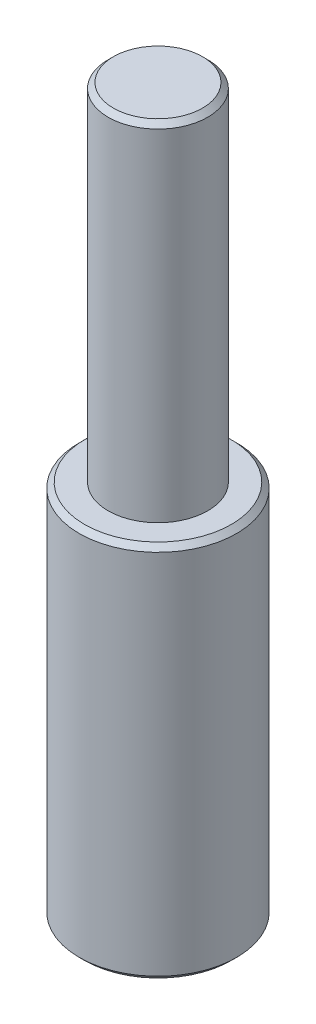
from build123d import *

# Parameters (mm, degrees)
SKETCH1_R                   = 1.5
BOSS_EXTRUDE1_DEPTH         = 7.2
SKETCH2_R                   = 0.95
BOSS_EXTRUDE2_DEPTH         = 6.6
CHAMFER1_SIZE               = 0.1
TAP_DRILL_FOR_M2_TAP1_D     = 1.6
TAP_DRILL_FOR_M2_TAP1_DEPTH = 5
TAP_DRILL_FOR_M2_TAP1_TIP   = 0.480688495


with BuildPart() as part:
    # Sketch1 → Boss-Extrude1 (new body)
    with BuildSketch(Plane(origin=(0, 0, 0), x_dir=(1, 0, 0), z_dir=(0, 1, 0))):
        with Locations(Location((0, 0, 0), (0, 0, 270))):
            Circle(SKETCH1_R)
    extrude(amount=BOSS_EXTRUDE1_DEPTH)

    # Sketch2 → Boss-Extrude2 (add)
    with BuildSketch(Plane(origin=(0, 7.2, 0), x_dir=(1, 0, 0), z_dir=(0, 1, 0))):
        with Locations(Location((0, 0, 0), (0, 0, 270))):
            Circle(SKETCH2_R)
    extrude(amount=BOSS_EXTRUDE2_DEPTH)

    # Chamfer1
    chamfer1_edges = [part.edges().sort_by_distance(p)[0] for p in [
        (0, 0, -1.5),
        (0, 7.2, -1.5),
        (0, 13.8, -0.95),
    ]]
    chamfer(chamfer1_edges, length=CHAMFER1_SIZE)

    # Tap Drill for M2 Tap1
    with Locations(Plane(origin=(0, 0, 0), x_dir=(-1, 0, 0), z_dir=(0, -1, 0))):
        with Locations((0, 0)):
            Hole(TAP_DRILL_FOR_M2_TAP1_D / 2, depth=TAP_DRILL_FOR_M2_TAP1_DEPTH)
            with Locations((0, 0, -(TAP_DRILL_FOR_M2_TAP1_DEPTH + TAP_DRILL_FOR_M2_TAP1_TIP / 2))):  # 118° drill point
                Cone(0, TAP_DRILL_FOR_M2_TAP1_D / 2, TAP_DRILL_FOR_M2_TAP1_TIP, mode=Mode.SUBTRACT)


solid = part.part
